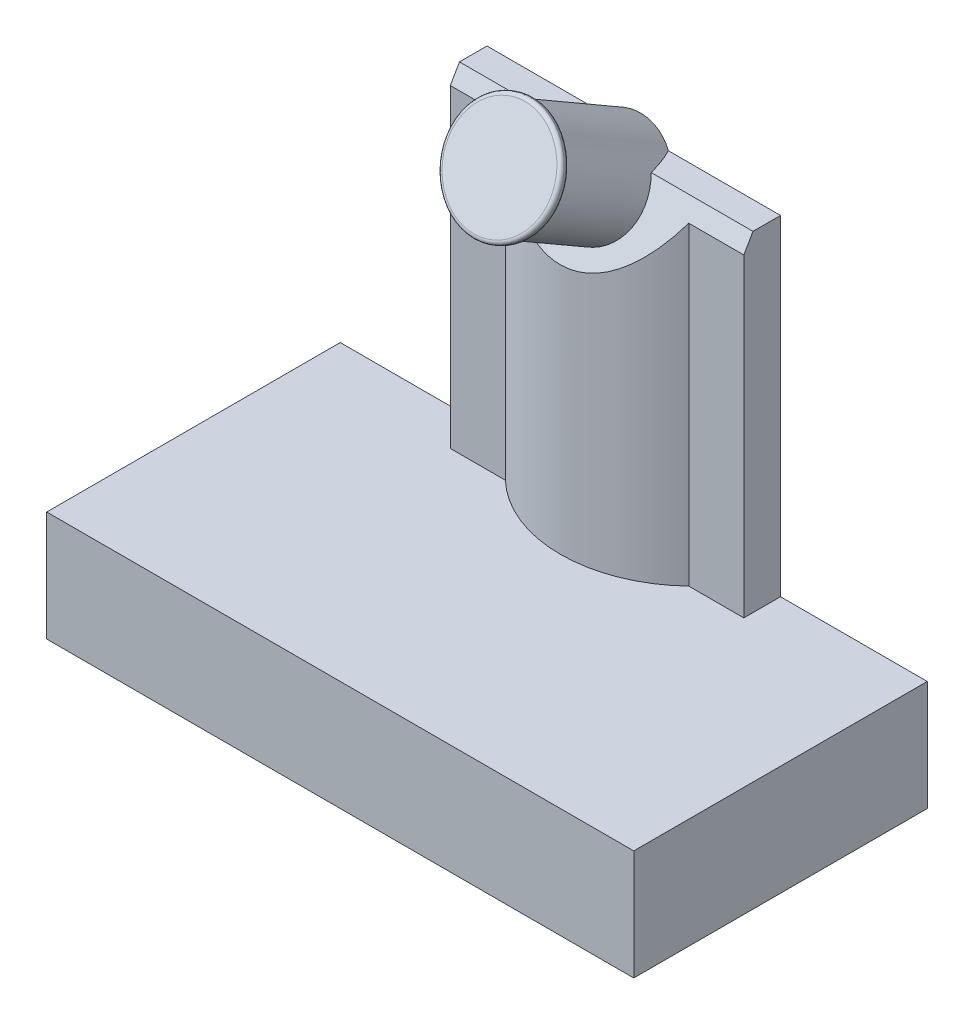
ISO-10303-21;
HEADER;
FILE_DESCRIPTION(('STEP AP214'),'2;1');
FILE_NAME('part.step','',(''),(''),'','','');
FILE_SCHEMA(('AUTOMOTIVE_DESIGN { 1 0 10303 214 1 1 1 1 }'));
ENDSEC;
DATA;
#1=APPLICATION_CONTEXT('core data for automotive mechanical design processes');
#2=APPLICATION_PROTOCOL_DEFINITION('international standard','automotive_design',2000,#1);
#3=PRODUCT_CONTEXT('',#1,'mechanical');
#4=PRODUCT('Part','Part','',(#3));
#5=PRODUCT_RELATED_PRODUCT_CATEGORY('part','',(#4));
#6=PRODUCT_DEFINITION_FORMATION('','',#4);
#7=PRODUCT_DEFINITION_CONTEXT('part definition',#1,'design');
#8=PRODUCT_DEFINITION('design','',#6,#7);
#9=PRODUCT_DEFINITION_SHAPE('','',#8);
#10=(LENGTH_UNIT() NAMED_UNIT(*) SI_UNIT(.MILLI.,.METRE.));
#11=(NAMED_UNIT(*) PLANE_ANGLE_UNIT() SI_UNIT($,.RADIAN.));
#12=(NAMED_UNIT(*) SI_UNIT($,.STERADIAN.) SOLID_ANGLE_UNIT());
#13=UNCERTAINTY_MEASURE_WITH_UNIT(LENGTH_MEASURE(1.E-05),#10,'distance_accuracy_value','');
#14=(GEOMETRIC_REPRESENTATION_CONTEXT(3) GLOBAL_UNCERTAINTY_ASSIGNED_CONTEXT((#13)) GLOBAL_UNIT_ASSIGNED_CONTEXT((#10,
#11,#12)) REPRESENTATION_CONTEXT('',''));
#15=CARTESIAN_POINT('',(0.,0.,0.));
#16=DIRECTION('',(0.,0.,1.));
#17=DIRECTION('',(1.,0.,0.));
#18=AXIS2_PLACEMENT_3D('',#15,#16,#17);
#19=CARTESIAN_POINT('',(8.,8.45873412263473,1.0625));
#20=DIRECTION('',(0.,-0.500000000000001,-0.866025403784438));
#21=DIRECTION('',(0.,0.866025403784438,-0.500000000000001));
#22=AXIS2_PLACEMENT_3D('',#19,#20,#21);
#23=CYLINDRICAL_SURFACE('',#22,1.375);
#24=CARTESIAN_POINT('',(8.,8.13397459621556,0.5));
#25=DIRECTION('',(0.,-0.500000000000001,-0.866025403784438));
#26=DIRECTION('',(0.,0.866025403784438,-0.500000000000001));
#27=AXIS2_PLACEMENT_3D('',#24,#25,#26);
#28=CIRCLE('',#27,1.375);
#29=CARTESIAN_POINT('',(7.05627069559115,9.,0.));
#30=VERTEX_POINT('',#29);
#31=CARTESIAN_POINT('',(8.94372930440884,9.,0.));
#32=VERTEX_POINT('',#31);
#33=EDGE_CURVE('E168',#30,#32,#28,.T.);
#34=ORIENTED_EDGE('',*,*,#33,.F.);
#35=CARTESIAN_POINT('',(8.,9.,1.99999999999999));
#36=DIRECTION('',(0.,1.,0.));
#37=DIRECTION('',(0.,0.,-1.));
#38=AXIS2_PLACEMENT_3D('',#35,#36,#37);
#39=ELLIPSE('',#38,2.74999999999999,1.375);
#40=CARTESIAN_POINT('',(6.77525512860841,9.,0.749999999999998));
#41=VERTEX_POINT('',#40);
#42=EDGE_CURVE('E167',#30,#41,#39,.T.);
#43=ORIENTED_EDGE('',*,*,#42,.T.);
#44=CARTESIAN_POINT('',(8.,8.45873412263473,1.0625));
#45=DIRECTION('',(0.,0.500000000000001,0.866025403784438));
#46=DIRECTION('',(0.,-0.866025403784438,0.500000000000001));
#47=AXIS2_PLACEMENT_3D('',#44,#45,#46);
#48=CIRCLE('',#47,1.375);
#49=CARTESIAN_POINT('',(9.22474487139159,9.,0.75));
#50=VERTEX_POINT('',#49);
#51=EDGE_CURVE('E55',#41,#50,#48,.T.);
#52=ORIENTED_EDGE('',*,*,#51,.T.);
#53=EDGE_CURVE('E161',#50,#32,#39,.T.);
#54=ORIENTED_EDGE('',*,*,#53,.T.);
#55=EDGE_LOOP('',(#34,#43,#52,#54));
#56=FACE_BOUND('',#55,.T.);
#57=CARTESIAN_POINT('',(8.,9.83373412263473,3.44406986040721));
#58=DIRECTION('',(0.,0.500000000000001,0.866025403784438));
#59=DIRECTION('',(0.,-0.866025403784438,0.500000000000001));
#60=AXIS2_PLACEMENT_3D('',#57,#58,#59);
#61=CIRCLE('',#60,1.375);
#62=CARTESIAN_POINT('',(8.,8.64294919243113,4.13156986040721));
#63=VERTEX_POINT('',#62);
#64=EDGE_CURVE('E345',#63,#63,#61,.F.);
#65=ORIENTED_EDGE('',*,*,#64,.T.);
#66=EDGE_LOOP('',(#65));
#67=FACE_BOUND('',#66,.T.);
#68=ADVANCED_FACE('F32',(#56,#67),#23,.T.);
#69=CARTESIAN_POINT('',(12.6906537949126,10.1622136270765,0.0789956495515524));
#70=DIRECTION('',(0.,-0.500000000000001,-0.866025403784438));
#71=DIRECTION('',(0.,0.866025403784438,-0.500000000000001));
#72=AXIS2_PLACEMENT_3D('',#69,#70,#71);
#73=PLANE('',#72);
#74=ORIENTED_EDGE('',*,*,#51,.F.);
#75=DIRECTION('',(1.,0.,0.));
#76=VECTOR('',#75,1.);
#77=CARTESIAN_POINT('',(5.5,9.,0.75));
#78=LINE('',#77,#76);
#79=CARTESIAN_POINT('',(4.,9.,0.749999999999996));
#80=VERTEX_POINT('',#79);
#81=EDGE_CURVE('E157',#80,#41,#78,.T.);
#82=ORIENTED_EDGE('',*,*,#81,.F.);
#83=DIRECTION('',(0.,0.866025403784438,-0.500000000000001));
#84=VECTOR('',#83,1.);
#85=CARTESIAN_POINT('',(4.,9.32475952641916,0.562499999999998));
#86=LINE('',#85,#84);
#87=CARTESIAN_POINT('',(4.,8.56698729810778,1.));
#88=VERTEX_POINT('',#87);
#89=EDGE_CURVE('E315',#88,#80,#86,.T.);
#90=ORIENTED_EDGE('',*,*,#89,.F.);
#91=DIRECTION('',(-1.,0.,0.));
#92=VECTOR('',#91,1.);
#93=CARTESIAN_POINT('',(4.,8.56698729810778,1.));
#94=LINE('',#93,#92);
#95=CARTESIAN_POINT('',(5.5,8.56698729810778,0.999999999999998));
#96=VERTEX_POINT('',#95);
#97=EDGE_CURVE('E319',#96,#88,#94,.T.);
#98=ORIENTED_EDGE('',*,*,#97,.F.);
#99=CARTESIAN_POINT('',(8.,13.1136206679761,-1.625));
#100=DIRECTION('',(0.,-0.500000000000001,-0.866025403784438));
#101=DIRECTION('',(0.,-0.866025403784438,0.500000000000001));
#102=AXIS2_PLACEMENT_3D('',#99,#100,#101);
#103=ELLIPSE('',#102,7.24999999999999,3.625);
#104=CARTESIAN_POINT('',(10.5,8.56698729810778,0.999999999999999));
#105=VERTEX_POINT('',#104);
#106=EDGE_CURVE('E335',#105,#96,#103,.T.);
#107=ORIENTED_EDGE('',*,*,#106,.F.);
#108=DIRECTION('',(-1.,0.,0.));
#109=VECTOR('',#108,1.);
#110=CARTESIAN_POINT('',(10.5,8.56698729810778,0.999999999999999));
#111=LINE('',#110,#109);
#112=CARTESIAN_POINT('',(12.,8.56698729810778,0.999999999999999));
#113=VERTEX_POINT('',#112);
#114=EDGE_CURVE('E338',#113,#105,#111,.T.);
#115=ORIENTED_EDGE('',*,*,#114,.F.);
#116=DIRECTION('',(0.,-0.866025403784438,0.500000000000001));
#117=VECTOR('',#116,1.);
#118=CARTESIAN_POINT('',(12.,9.32475952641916,0.562499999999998));
#119=LINE('',#118,#117);
#120=CARTESIAN_POINT('',(12.,9.,0.749999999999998));
#121=VERTEX_POINT('',#120);
#122=EDGE_CURVE('E154',#121,#113,#119,.T.);
#123=ORIENTED_EDGE('',*,*,#122,.F.);
#124=EDGE_CURVE('E150',#50,#121,#78,.T.);
#125=ORIENTED_EDGE('',*,*,#124,.F.);
#126=EDGE_LOOP('',(#74,#82,#90,#98,#107,#115,#123,#125));
#127=FACE_BOUND('',#126,.T.);
#128=ADVANCED_FACE('F152',(#127),#73,.F.);
#129=CARTESIAN_POINT('',(8.,9.,-1.625));
#130=DIRECTION('',(0.,1.,0.));
#131=DIRECTION('',(0.,0.,1.));
#132=AXIS2_PLACEMENT_3D('',#129,#130,#131);
#133=PLANE('',#132);
#134=ORIENTED_EDGE('',*,*,#42,.F.);
#135=DIRECTION('',(-1.,0.,0.));
#136=VECTOR('',#135,1.);
#137=CARTESIAN_POINT('',(4.,9.,0.));
#138=LINE('',#137,#136);
#139=CARTESIAN_POINT('',(4.,9.,0.));
#140=VERTEX_POINT('',#139);
#141=EDGE_CURVE('E325',#30,#140,#138,.T.);
#142=ORIENTED_EDGE('',*,*,#141,.T.);
#143=DIRECTION('',(0.,0.,1.));
#144=VECTOR('',#143,1.);
#145=CARTESIAN_POINT('',(4.,9.,0.));
#146=LINE('',#145,#144);
#147=EDGE_CURVE('E198',#140,#80,#146,.T.);
#148=ORIENTED_EDGE('',*,*,#147,.T.);
#149=ORIENTED_EDGE('',*,*,#81,.T.);
#150=EDGE_LOOP('',(#134,#142,#148,#149));
#151=FACE_BOUND('',#150,.T.);
#152=ADVANCED_FACE('F384',(#151),#133,.T.);
#153=CARTESIAN_POINT('',(0.,-0.999999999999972,8.));
#154=DIRECTION('',(0.,1.,0.));
#155=DIRECTION('',(0.,0.,1.));
#156=AXIS2_PLACEMENT_3D('',#153,#154,#155);
#157=PLANE('',#156);
#158=DIRECTION('',(-1.,0.,0.));
#159=VECTOR('',#158,1.);
#160=CARTESIAN_POINT('',(0.999999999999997,-0.999999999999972,7.));
#161=LINE('',#160,#159);
#162=CARTESIAN_POINT('',(15.,-0.999999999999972,7.));
#163=VERTEX_POINT('',#162);
#164=CARTESIAN_POINT('',(0.999999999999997,-0.999999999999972,7.));
#165=VERTEX_POINT('',#164);
#166=EDGE_CURVE('E226',#163,#165,#161,.T.);
#167=ORIENTED_EDGE('',*,*,#166,.T.);
#168=DIRECTION('',(0.,0.,-1.));
#169=VECTOR('',#168,1.);
#170=CARTESIAN_POINT('',(0.999999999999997,-0.999999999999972,0.999999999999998));
#171=LINE('',#170,#169);
#172=CARTESIAN_POINT('',(0.999999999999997,-0.999999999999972,0.999999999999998));
#173=VERTEX_POINT('',#172);
#174=EDGE_CURVE('E222',#165,#173,#171,.T.);
#175=ORIENTED_EDGE('',*,*,#174,.T.);
#176=DIRECTION('',(1.,0.,0.));
#177=VECTOR('',#176,1.);
#178=CARTESIAN_POINT('',(0.999999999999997,-0.999999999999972,0.999999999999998));
#179=LINE('',#178,#177);
#180=CARTESIAN_POINT('',(15.,-0.999999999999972,0.999999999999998));
#181=VERTEX_POINT('',#180);
#182=EDGE_CURVE('E236',#173,#181,#179,.T.);
#183=ORIENTED_EDGE('',*,*,#182,.T.);
#184=DIRECTION('',(0.,0.,1.));
#185=VECTOR('',#184,1.);
#186=CARTESIAN_POINT('',(15.,-0.999999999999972,0.999999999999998));
#187=LINE('',#186,#185);
#188=EDGE_CURVE('E239',#181,#163,#187,.T.);
#189=ORIENTED_EDGE('',*,*,#188,.T.);
#190=EDGE_LOOP('',(#167,#175,#183,#189));
#191=FACE_BOUND('',#190,.T.);
#192=CARTESIAN_POINT('',(8.,-0.999999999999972,4.));
#193=DIRECTION('',(0.,1.,0.));
#194=DIRECTION('',(0.,0.,1.));
#195=AXIS2_PLACEMENT_3D('',#192,#193,#194);
#196=CIRCLE('',#195,1.5);
#197=CARTESIAN_POINT('',(8.,-0.999999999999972,5.5));
#198=VERTEX_POINT('',#197);
#199=EDGE_CURVE('E158',#198,#198,#196,.F.);
#200=ORIENTED_EDGE('',*,*,#199,.F.);
#201=EDGE_LOOP('',(#200));
#202=FACE_BOUND('',#201,.T.);
#203=ADVANCED_FACE('F444',(#191,#202),#157,.F.);
#204=CARTESIAN_POINT('',(0.,-0.999999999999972,0.));
#205=DIRECTION('',(-1.,0.,0.));
#206=DIRECTION('',(0.,0.,1.));
#207=AXIS2_PLACEMENT_3D('',#204,#205,#206);
#208=PLANE('',#207);
#209=DIRECTION('',(0.,0.,1.));
#210=VECTOR('',#209,1.);
#211=CARTESIAN_POINT('',(0.,0.,0.));
#212=LINE('',#211,#210);
#213=CARTESIAN_POINT('',(0.,0.,0.));
#214=VERTEX_POINT('',#213);
#215=CARTESIAN_POINT('',(0.,0.,8.));
#216=VERTEX_POINT('',#215);
#217=EDGE_CURVE('E264',#214,#216,#212,.T.);
#218=ORIENTED_EDGE('',*,*,#217,.F.);
#219=DIRECTION('',(0.,1.,0.));
#220=VECTOR('',#219,1.);
#221=CARTESIAN_POINT('',(0.,-0.999999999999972,0.));
#222=LINE('',#221,#220);
#223=CARTESIAN_POINT('',(0.,-2.99999999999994,0.));
#224=VERTEX_POINT('',#223);
#225=EDGE_CURVE('E276',#224,#214,#222,.T.);
#226=ORIENTED_EDGE('',*,*,#225,.F.);
#227=DIRECTION('',(0.,0.,-1.));
#228=VECTOR('',#227,1.);
#229=CARTESIAN_POINT('',(0.,-2.99999999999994,8.));
#230=LINE('',#229,#228);
#231=CARTESIAN_POINT('',(0.,-2.99999999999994,8.));
#232=VERTEX_POINT('',#231);
#233=EDGE_CURVE('E258',#232,#224,#230,.T.);
#234=ORIENTED_EDGE('',*,*,#233,.F.);
#235=DIRECTION('',(0.,1.,0.));
#236=VECTOR('',#235,1.);
#237=CARTESIAN_POINT('',(0.,-0.999999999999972,8.));
#238=LINE('',#237,#236);
#239=EDGE_CURVE('E284',#232,#216,#238,.T.);
#240=ORIENTED_EDGE('',*,*,#239,.T.);
#241=EDGE_LOOP('',(#218,#226,#234,#240));
#242=FACE_BOUND('',#241,.T.);
#243=ADVANCED_FACE('F303',(#242),#208,.T.);
#244=CARTESIAN_POINT('',(0.,-0.999999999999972,0.));
#245=DIRECTION('',(0.,0.,-1.));
#246=DIRECTION('',(-1.,0.,0.));
#247=AXIS2_PLACEMENT_3D('',#244,#245,#246);
#248=PLANE('',#247);
#249=DIRECTION('',(-1.,0.,0.));
#250=VECTOR('',#249,1.);
#251=CARTESIAN_POINT('',(0.,0.,0.));
#252=LINE('',#251,#250);
#253=CARTESIAN_POINT('',(16.,0.,0.));
#254=VERTEX_POINT('',#253);
#255=CARTESIAN_POINT('',(12.,0.,0.));
#256=VERTEX_POINT('',#255);
#257=EDGE_CURVE('E282',#254,#256,#252,.T.);
#258=ORIENTED_EDGE('',*,*,#257,.F.);
#259=DIRECTION('',(0.,1.,0.));
#260=VECTOR('',#259,1.);
#261=CARTESIAN_POINT('',(16.,-0.999999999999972,0.));
#262=LINE('',#261,#260);
#263=CARTESIAN_POINT('',(16.,-2.99999999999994,0.));
#264=VERTEX_POINT('',#263);
#265=EDGE_CURVE('E289',#264,#254,#262,.T.);
#266=ORIENTED_EDGE('',*,*,#265,.F.);
#267=DIRECTION('',(1.,0.,0.));
#268=VECTOR('',#267,1.);
#269=CARTESIAN_POINT('',(16.,-2.99999999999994,0.));
#270=LINE('',#269,#268);
#271=EDGE_CURVE('E261',#224,#264,#270,.T.);
#272=ORIENTED_EDGE('',*,*,#271,.F.);
#273=ORIENTED_EDGE('',*,*,#225,.T.);
#274=CARTESIAN_POINT('',(4.,0.,0.));
#275=VERTEX_POINT('',#274);
#276=EDGE_CURVE('E273',#275,#214,#252,.T.);
#277=ORIENTED_EDGE('',*,*,#276,.F.);
#278=DIRECTION('',(0.,-1.,0.));
#279=VECTOR('',#278,1.);
#280=CARTESIAN_POINT('',(4.,9.,0.));
#281=LINE('',#280,#279);
#282=EDGE_CURVE('E193',#140,#275,#281,.T.);
#283=ORIENTED_EDGE('',*,*,#282,.F.);
#284=ORIENTED_EDGE('',*,*,#141,.F.);
#285=EDGE_CURVE('E47',#32,#30,#138,.T.);
#286=ORIENTED_EDGE('',*,*,#285,.F.);
#287=CARTESIAN_POINT('',(12.,9.,0.));
#288=VERTEX_POINT('',#287);
#289=EDGE_CURVE('E163',#288,#32,#138,.T.);
#290=ORIENTED_EDGE('',*,*,#289,.F.);
#291=DIRECTION('',(0.,-1.,0.));
#292=VECTOR('',#291,1.);
#293=CARTESIAN_POINT('',(12.,9.,0.));
#294=LINE('',#293,#292);
#295=EDGE_CURVE('E189',#288,#256,#294,.T.);
#296=ORIENTED_EDGE('',*,*,#295,.T.);
#297=EDGE_LOOP('',(#258,#266,#272,#273,#277,#283,#284,#286,#290,#296));
#298=FACE_BOUND('',#297,.T.);
#299=ADVANCED_FACE('F298',(#298),#248,.T.);
#300=CARTESIAN_POINT('',(16.,-0.999999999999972,0.));
#301=DIRECTION('',(1.,0.,0.));
#302=DIRECTION('',(0.,0.,-1.));
#303=AXIS2_PLACEMENT_3D('',#300,#301,#302);
#304=PLANE('',#303);
#305=DIRECTION('',(0.,0.,-1.));
#306=VECTOR('',#305,1.);
#307=CARTESIAN_POINT('',(16.,0.,0.));
#308=LINE('',#307,#306);
#309=CARTESIAN_POINT('',(16.,0.,8.));
#310=VERTEX_POINT('',#309);
#311=EDGE_CURVE('E270',#310,#254,#308,.T.);
#312=ORIENTED_EDGE('',*,*,#311,.F.);
#313=DIRECTION('',(0.,1.,0.));
#314=VECTOR('',#313,1.);
#315=CARTESIAN_POINT('',(16.,-0.999999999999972,8.));
#316=LINE('',#315,#314);
#317=CARTESIAN_POINT('',(16.,-2.99999999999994,8.));
#318=VERTEX_POINT('',#317);
#319=EDGE_CURVE('E288',#318,#310,#316,.T.);
#320=ORIENTED_EDGE('',*,*,#319,.F.);
#321=DIRECTION('',(0.,0.,1.));
#322=VECTOR('',#321,1.);
#323=CARTESIAN_POINT('',(16.,-2.99999999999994,8.));
#324=LINE('',#323,#322);
#325=EDGE_CURVE('E252',#264,#318,#324,.T.);
#326=ORIENTED_EDGE('',*,*,#325,.F.);
#327=ORIENTED_EDGE('',*,*,#265,.T.);
#328=EDGE_LOOP('',(#312,#320,#326,#327));
#329=FACE_BOUND('',#328,.T.);
#330=ADVANCED_FACE('F450',(#329),#304,.T.);
#331=CARTESIAN_POINT('',(0.,-0.999999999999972,8.));
#332=DIRECTION('',(0.,0.,1.));
#333=DIRECTION('',(1.,0.,0.));
#334=AXIS2_PLACEMENT_3D('',#331,#332,#333);
#335=PLANE('',#334);
#336=DIRECTION('',(1.,0.,0.));
#337=VECTOR('',#336,1.);
#338=CARTESIAN_POINT('',(0.,0.,8.));
#339=LINE('',#338,#337);
#340=EDGE_CURVE('E267',#216,#310,#339,.T.);
#341=ORIENTED_EDGE('',*,*,#340,.F.);
#342=ORIENTED_EDGE('',*,*,#239,.F.);
#343=DIRECTION('',(-1.,0.,0.));
#344=VECTOR('',#343,1.);
#345=CARTESIAN_POINT('',(16.,-2.99999999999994,8.));
#346=LINE('',#345,#344);
#347=EDGE_CURVE('E255',#318,#232,#346,.T.);
#348=ORIENTED_EDGE('',*,*,#347,.F.);
#349=ORIENTED_EDGE('',*,*,#319,.T.);
#350=EDGE_LOOP('',(#341,#342,#348,#349));
#351=FACE_BOUND('',#350,.T.);
#352=ADVANCED_FACE('F447',(#351),#335,.T.);
#353=CARTESIAN_POINT('',(0.,0.,8.));
#354=DIRECTION('',(0.,1.,0.));
#355=DIRECTION('',(0.,0.,1.));
#356=AXIS2_PLACEMENT_3D('',#353,#354,#355);
#357=PLANE('',#356);
#358=DIRECTION('',(0.,0.,1.));
#359=VECTOR('',#358,1.);
#360=CARTESIAN_POINT('',(4.,0.,0.));
#361=LINE('',#360,#359);
#362=CARTESIAN_POINT('',(4.,0.,1.));
#363=VERTEX_POINT('',#362);
#364=EDGE_CURVE('E309',#275,#363,#361,.T.);
#365=ORIENTED_EDGE('',*,*,#364,.F.);
#366=ORIENTED_EDGE('',*,*,#276,.T.);
#367=ORIENTED_EDGE('',*,*,#217,.T.);
#368=ORIENTED_EDGE('',*,*,#340,.T.);
#369=ORIENTED_EDGE('',*,*,#311,.T.);
#370=ORIENTED_EDGE('',*,*,#257,.T.);
#371=DIRECTION('',(0.,0.,-1.));
#372=VECTOR('',#371,1.);
#373=CARTESIAN_POINT('',(12.,0.,0.));
#374=LINE('',#373,#372);
#375=CARTESIAN_POINT('',(12.,0.,0.999999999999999));
#376=VERTEX_POINT('',#375);
#377=EDGE_CURVE('E194',#376,#256,#374,.T.);
#378=ORIENTED_EDGE('',*,*,#377,.F.);
#379=DIRECTION('',(1.,0.,0.));
#380=VECTOR('',#379,1.);
#381=CARTESIAN_POINT('',(10.5,0.,0.999999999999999));
#382=LINE('',#381,#380);
#383=CARTESIAN_POINT('',(10.5,0.,0.999999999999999));
#384=VERTEX_POINT('',#383);
#385=EDGE_CURVE('E199',#384,#376,#382,.T.);
#386=ORIENTED_EDGE('',*,*,#385,.F.);
#387=CARTESIAN_POINT('',(8.,0.,-1.625));
#388=DIRECTION('',(0.,1.,0.));
#389=DIRECTION('',(0.,0.,1.));
#390=AXIS2_PLACEMENT_3D('',#387,#388,#389);
#391=CIRCLE('',#390,3.625);
#392=CARTESIAN_POINT('',(5.5,0.,0.999999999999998));
#393=VERTEX_POINT('',#392);
#394=EDGE_CURVE('E316',#393,#384,#391,.T.);
#395=ORIENTED_EDGE('',*,*,#394,.F.);
#396=DIRECTION('',(1.,0.,0.));
#397=VECTOR('',#396,1.);
#398=CARTESIAN_POINT('',(4.,0.,1.));
#399=LINE('',#398,#397);
#400=EDGE_CURVE('E312',#363,#393,#399,.T.);
#401=ORIENTED_EDGE('',*,*,#400,.F.);
#402=EDGE_LOOP('',(#365,#366,#367,#368,#369,#370,#378,#386,#395,#401));
#403=FACE_BOUND('',#402,.T.);
#404=ADVANCED_FACE('F306',(#403),#357,.T.);
#405=CARTESIAN_POINT('',(16.,-2.99999999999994,0.));
#406=DIRECTION('',(0.,1.,0.));
#407=DIRECTION('',(0.,0.,1.));
#408=AXIS2_PLACEMENT_3D('',#405,#406,#407);
#409=PLANE('',#408);
#410=ORIENTED_EDGE('',*,*,#325,.T.);
#411=ORIENTED_EDGE('',*,*,#347,.T.);
#412=ORIENTED_EDGE('',*,*,#233,.T.);
#413=ORIENTED_EDGE('',*,*,#271,.T.);
#414=EDGE_LOOP('',(#410,#411,#412,#413));
#415=FACE_BOUND('',#414,.T.);
#416=DIRECTION('',(0.,0.,-1.));
#417=VECTOR('',#416,1.);
#418=CARTESIAN_POINT('',(0.999999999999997,-2.99999999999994,0.999999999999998));
#419=LINE('',#418,#417);
#420=CARTESIAN_POINT('',(0.999999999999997,-2.99999999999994,7.));
#421=VERTEX_POINT('',#420);
#422=CARTESIAN_POINT('',(0.999999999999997,-2.99999999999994,0.999999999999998));
#423=VERTEX_POINT('',#422);
#424=EDGE_CURVE('E223',#421,#423,#419,.T.);
#425=ORIENTED_EDGE('',*,*,#424,.F.);
#426=DIRECTION('',(-1.,0.,0.));
#427=VECTOR('',#426,1.);
#428=CARTESIAN_POINT('',(0.999999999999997,-2.99999999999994,7.));
#429=LINE('',#428,#427);
#430=CARTESIAN_POINT('',(15.,-2.99999999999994,7.));
#431=VERTEX_POINT('',#430);
#432=EDGE_CURVE('E231',#431,#421,#429,.T.);
#433=ORIENTED_EDGE('',*,*,#432,.F.);
#434=DIRECTION('',(0.,0.,1.));
#435=VECTOR('',#434,1.);
#436=CARTESIAN_POINT('',(15.,-2.99999999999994,0.999999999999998));
#437=LINE('',#436,#435);
#438=CARTESIAN_POINT('',(15.,-2.99999999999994,0.999999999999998));
#439=VERTEX_POINT('',#438);
#440=EDGE_CURVE('E228',#439,#431,#437,.T.);
#441=ORIENTED_EDGE('',*,*,#440,.F.);
#442=DIRECTION('',(1.,0.,0.));
#443=VECTOR('',#442,1.);
#444=CARTESIAN_POINT('',(0.999999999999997,-2.99999999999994,0.999999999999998));
#445=LINE('',#444,#443);
#446=EDGE_CURVE('E225',#423,#439,#445,.T.);
#447=ORIENTED_EDGE('',*,*,#446,.F.);
#448=EDGE_LOOP('',(#425,#433,#441,#447));
#449=FACE_BOUND('',#448,.T.);
#450=ADVANCED_FACE('F436',(#415,#449),#409,.F.);
#451=CARTESIAN_POINT('',(0.999999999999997,-2.99999999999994,0.999999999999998));
#452=DIRECTION('',(1.,0.,0.));
#453=DIRECTION('',(0.,0.,-1.));
#454=AXIS2_PLACEMENT_3D('',#451,#452,#453);
#455=PLANE('',#454);
#456=ORIENTED_EDGE('',*,*,#174,.F.);
#457=DIRECTION('',(0.,1.,0.));
#458=VECTOR('',#457,1.);
#459=CARTESIAN_POINT('',(0.999999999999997,-2.99999999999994,7.));
#460=LINE('',#459,#458);
#461=EDGE_CURVE('E233',#421,#165,#460,.T.);
#462=ORIENTED_EDGE('',*,*,#461,.F.);
#463=ORIENTED_EDGE('',*,*,#424,.T.);
#464=DIRECTION('',(0.,1.,0.));
#465=VECTOR('',#464,1.);
#466=CARTESIAN_POINT('',(0.999999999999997,-2.99999999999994,0.999999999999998));
#467=LINE('',#466,#465);
#468=EDGE_CURVE('E249',#423,#173,#467,.T.);
#469=ORIENTED_EDGE('',*,*,#468,.T.);
#470=EDGE_LOOP('',(#456,#462,#463,#469));
#471=FACE_BOUND('',#470,.T.);
#472=ADVANCED_FACE('F432',(#471),#455,.T.);
#473=CARTESIAN_POINT('',(0.999999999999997,-2.99999999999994,0.999999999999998));
#474=DIRECTION('',(0.,0.,1.));
#475=DIRECTION('',(1.,0.,0.));
#476=AXIS2_PLACEMENT_3D('',#473,#474,#475);
#477=PLANE('',#476);
#478=ORIENTED_EDGE('',*,*,#182,.F.);
#479=ORIENTED_EDGE('',*,*,#468,.F.);
#480=ORIENTED_EDGE('',*,*,#446,.T.);
#481=DIRECTION('',(0.,1.,0.));
#482=VECTOR('',#481,1.);
#483=CARTESIAN_POINT('',(15.,-2.99999999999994,0.999999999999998));
#484=LINE('',#483,#482);
#485=EDGE_CURVE('E247',#439,#181,#484,.T.);
#486=ORIENTED_EDGE('',*,*,#485,.T.);
#487=EDGE_LOOP('',(#478,#479,#480,#486));
#488=FACE_BOUND('',#487,.T.);
#489=ADVANCED_FACE('F428',(#488),#477,.T.);
#490=CARTESIAN_POINT('',(15.,-2.99999999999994,0.999999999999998));
#491=DIRECTION('',(-1.,0.,0.));
#492=DIRECTION('',(0.,0.,1.));
#493=AXIS2_PLACEMENT_3D('',#490,#491,#492);
#494=PLANE('',#493);
#495=ORIENTED_EDGE('',*,*,#188,.F.);
#496=ORIENTED_EDGE('',*,*,#485,.F.);
#497=ORIENTED_EDGE('',*,*,#440,.T.);
#498=DIRECTION('',(0.,1.,0.));
#499=VECTOR('',#498,1.);
#500=CARTESIAN_POINT('',(15.,-2.99999999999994,7.));
#501=LINE('',#500,#499);
#502=EDGE_CURVE('E245',#431,#163,#501,.T.);
#503=ORIENTED_EDGE('',*,*,#502,.T.);
#504=EDGE_LOOP('',(#495,#496,#497,#503));
#505=FACE_BOUND('',#504,.T.);
#506=ADVANCED_FACE('F424',(#505),#494,.T.);
#507=CARTESIAN_POINT('',(0.999999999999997,-2.99999999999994,7.));
#508=DIRECTION('',(0.,0.,-1.));
#509=DIRECTION('',(-1.,0.,0.));
#510=AXIS2_PLACEMENT_3D('',#507,#508,#509);
#511=PLANE('',#510);
#512=ORIENTED_EDGE('',*,*,#166,.F.);
#513=ORIENTED_EDGE('',*,*,#502,.F.);
#514=ORIENTED_EDGE('',*,*,#432,.T.);
#515=ORIENTED_EDGE('',*,*,#461,.T.);
#516=EDGE_LOOP('',(#512,#513,#514,#515));
#517=FACE_BOUND('',#516,.T.);
#518=ADVANCED_FACE('F417',(#517),#511,.T.);
#519=CARTESIAN_POINT('',(8.,-2.99999999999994,4.));
#520=DIRECTION('',(0.,-1.,0.));
#521=DIRECTION('',(0.,0.,-1.));
#522=AXIS2_PLACEMENT_3D('',#519,#520,#521);
#523=PLANE('',#522);
#524=CARTESIAN_POINT('',(8.,-2.99999999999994,4.));
#525=DIRECTION('',(0.,-1.,0.));
#526=DIRECTION('',(0.,0.,-1.));
#527=AXIS2_PLACEMENT_3D('',#524,#525,#526);
#528=CIRCLE('',#527,1.5);
#529=CARTESIAN_POINT('',(8.,-2.99999999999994,2.5));
#530=VERTEX_POINT('',#529);
#531=EDGE_CURVE('E217',#530,#530,#528,.T.);
#532=ORIENTED_EDGE('',*,*,#531,.T.);
#533=EDGE_LOOP('',(#532));
#534=FACE_BOUND('',#533,.T.);
#535=CARTESIAN_POINT('',(8.,-2.99999999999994,4.));
#536=DIRECTION('',(0.,-1.,0.));
#537=DIRECTION('',(0.,0.,-1.));
#538=AXIS2_PLACEMENT_3D('',#535,#536,#537);
#539=CIRCLE('',#538,1.);
#540=CARTESIAN_POINT('',(8.,-2.99999999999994,3.));
#541=VERTEX_POINT('',#540);
#542=EDGE_CURVE('E214',#541,#541,#539,.T.);
#543=ORIENTED_EDGE('',*,*,#542,.F.);
#544=EDGE_LOOP('',(#543));
#545=FACE_BOUND('',#544,.T.);
#546=ADVANCED_FACE('F414',(#534,#545),#523,.T.);
#547=CARTESIAN_POINT('',(8.,-2.99999999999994,4.));
#548=DIRECTION('',(0.,1.,0.));
#549=DIRECTION('',(0.,0.,1.));
#550=AXIS2_PLACEMENT_3D('',#547,#548,#549);
#551=CYLINDRICAL_SURFACE('',#550,1.5);
#552=ORIENTED_EDGE('',*,*,#531,.F.);
#553=EDGE_LOOP('',(#552));
#554=FACE_BOUND('',#553,.T.);
#555=ORIENTED_EDGE('',*,*,#199,.T.);
#556=EDGE_LOOP('',(#555));
#557=FACE_BOUND('',#556,.T.);
#558=ADVANCED_FACE('F412',(#554,#557),#551,.T.);
#559=CARTESIAN_POINT('',(8.,-2.99999999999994,4.));
#560=DIRECTION('',(0.,1.,0.));
#561=DIRECTION('',(0.,0.,1.));
#562=AXIS2_PLACEMENT_3D('',#559,#560,#561);
#563=CYLINDRICAL_SURFACE('',#562,1.);
#564=ORIENTED_EDGE('',*,*,#542,.T.);
#565=EDGE_LOOP('',(#564));
#566=FACE_BOUND('',#565,.T.);
#567=CARTESIAN_POINT('',(8.,-0.999999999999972,4.));
#568=DIRECTION('',(0.,-1.,0.));
#569=DIRECTION('',(0.,0.,-1.));
#570=AXIS2_PLACEMENT_3D('',#567,#568,#569);
#571=CIRCLE('',#570,1.);
#572=CARTESIAN_POINT('',(8.,-0.999999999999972,3.));
#573=VERTEX_POINT('',#572);
#574=EDGE_CURVE('E213',#573,#573,#571,.T.);
#575=ORIENTED_EDGE('',*,*,#574,.F.);
#576=EDGE_LOOP('',(#575));
#577=FACE_BOUND('',#576,.T.);
#578=ADVANCED_FACE('F409',(#566,#577),#563,.F.);
#579=ORIENTED_EDGE('',*,*,#574,.T.);
#580=EDGE_LOOP('',(#579));
#581=FACE_BOUND('',#580,.T.);
#582=ADVANCED_FACE('F408',(#581),#157,.F.);
#583=CARTESIAN_POINT('',(4.,9.,0.));
#584=DIRECTION('',(1.,0.,0.));
#585=DIRECTION('',(0.,0.,-1.));
#586=AXIS2_PLACEMENT_3D('',#583,#584,#585);
#587=PLANE('',#586);
#588=DIRECTION('',(0.,-1.,0.));
#589=VECTOR('',#588,1.);
#590=CARTESIAN_POINT('',(4.,9.,1.));
#591=LINE('',#590,#589);
#592=EDGE_CURVE('E211',#88,#363,#591,.T.);
#593=ORIENTED_EDGE('',*,*,#592,.F.);
#594=ORIENTED_EDGE('',*,*,#89,.T.);
#595=ORIENTED_EDGE('',*,*,#147,.F.);
#596=ORIENTED_EDGE('',*,*,#282,.T.);
#597=ORIENTED_EDGE('',*,*,#364,.T.);
#598=EDGE_LOOP('',(#593,#594,#595,#596,#597));
#599=FACE_BOUND('',#598,.T.);
#600=ADVANCED_FACE('F404',(#599),#587,.F.);
#601=CARTESIAN_POINT('',(4.,9.,1.));
#602=DIRECTION('',(0.,0.,-1.));
#603=DIRECTION('',(-1.,0.,0.));
#604=AXIS2_PLACEMENT_3D('',#601,#602,#603);
#605=PLANE('',#604);
#606=DIRECTION('',(0.,-1.,0.));
#607=VECTOR('',#606,1.);
#608=CARTESIAN_POINT('',(5.5,9.,0.999999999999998));
#609=LINE('',#608,#607);
#610=EDGE_CURVE('E209',#96,#393,#609,.T.);
#611=ORIENTED_EDGE('',*,*,#610,.F.);
#612=ORIENTED_EDGE('',*,*,#97,.T.);
#613=ORIENTED_EDGE('',*,*,#592,.T.);
#614=ORIENTED_EDGE('',*,*,#400,.T.);
#615=EDGE_LOOP('',(#611,#612,#613,#614));
#616=FACE_BOUND('',#615,.T.);
#617=ADVANCED_FACE('F400',(#616),#605,.F.);
#618=CARTESIAN_POINT('',(8.,9.,-1.625));
#619=DIRECTION('',(0.,-1.,0.));
#620=DIRECTION('',(0.,0.,-1.));
#621=AXIS2_PLACEMENT_3D('',#618,#619,#620);
#622=CYLINDRICAL_SURFACE('',#621,3.625);
#623=DIRECTION('',(0.,-1.,0.));
#624=VECTOR('',#623,1.);
#625=CARTESIAN_POINT('',(10.5,9.,0.999999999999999));
#626=LINE('',#625,#624);
#627=EDGE_CURVE('E207',#105,#384,#626,.T.);
#628=ORIENTED_EDGE('',*,*,#627,.F.);
#629=ORIENTED_EDGE('',*,*,#106,.T.);
#630=ORIENTED_EDGE('',*,*,#610,.T.);
#631=ORIENTED_EDGE('',*,*,#394,.T.);
#632=EDGE_LOOP('',(#628,#629,#630,#631));
#633=FACE_BOUND('',#632,.T.);
#634=ADVANCED_FACE('F396',(#633),#622,.T.);
#635=CARTESIAN_POINT('',(10.5,9.,0.999999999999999));
#636=DIRECTION('',(0.,0.,-1.));
#637=DIRECTION('',(-1.,0.,0.));
#638=AXIS2_PLACEMENT_3D('',#635,#636,#637);
#639=PLANE('',#638);
#640=DIRECTION('',(0.,-1.,0.));
#641=VECTOR('',#640,1.);
#642=CARTESIAN_POINT('',(12.,9.,0.999999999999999));
#643=LINE('',#642,#641);
#644=EDGE_CURVE('E192',#113,#376,#643,.T.);
#645=ORIENTED_EDGE('',*,*,#644,.F.);
#646=ORIENTED_EDGE('',*,*,#114,.T.);
#647=ORIENTED_EDGE('',*,*,#627,.T.);
#648=ORIENTED_EDGE('',*,*,#385,.T.);
#649=EDGE_LOOP('',(#645,#646,#647,#648));
#650=FACE_BOUND('',#649,.T.);
#651=ADVANCED_FACE('F392',(#650),#639,.F.);
#652=CARTESIAN_POINT('',(12.,9.,0.));
#653=DIRECTION('',(-1.,0.,0.));
#654=DIRECTION('',(0.,0.,1.));
#655=AXIS2_PLACEMENT_3D('',#652,#653,#654);
#656=PLANE('',#655);
#657=DIRECTION('',(0.,0.,-1.));
#658=VECTOR('',#657,1.);
#659=CARTESIAN_POINT('',(12.,9.,0.));
#660=LINE('',#659,#658);
#661=EDGE_CURVE('E327',#121,#288,#660,.T.);
#662=ORIENTED_EDGE('',*,*,#661,.F.);
#663=ORIENTED_EDGE('',*,*,#122,.T.);
#664=ORIENTED_EDGE('',*,*,#644,.T.);
#665=ORIENTED_EDGE('',*,*,#377,.T.);
#666=ORIENTED_EDGE('',*,*,#295,.F.);
#667=EDGE_LOOP('',(#662,#663,#664,#665,#666));
#668=FACE_BOUND('',#667,.T.);
#669=ADVANCED_FACE('F389',(#668),#656,.F.);
#670=ORIENTED_EDGE('',*,*,#53,.F.);
#671=ORIENTED_EDGE('',*,*,#124,.T.);
#672=ORIENTED_EDGE('',*,*,#661,.T.);
#673=ORIENTED_EDGE('',*,*,#289,.T.);
#674=EDGE_LOOP('',(#670,#671,#672,#673));
#675=FACE_BOUND('',#674,.T.);
#676=ADVANCED_FACE('F162',(#675),#133,.T.);
#677=CARTESIAN_POINT('',(8.,8.13397459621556,0.5));
#678=DIRECTION('',(0.,-0.500000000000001,-0.866025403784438));
#679=DIRECTION('',(0.,0.866025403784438,-0.500000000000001));
#680=AXIS2_PLACEMENT_3D('',#677,#678,#679);
#681=PLANE('',#680);
#682=ORIENTED_EDGE('',*,*,#33,.T.);
#683=ORIENTED_EDGE('',*,*,#285,.T.);
#684=EDGE_LOOP('',(#682,#683));
#685=FACE_BOUND('',#684,.T.);
#686=ADVANCED_FACE('F364',(#685),#681,.T.);
#687=CARTESIAN_POINT('',(8.,9.83373412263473,3.44406986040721));
#688=DIRECTION('',(0.,0.500000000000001,0.866025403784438));
#689=DIRECTION('',(0.,-0.866025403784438,0.500000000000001));
#690=AXIS2_PLACEMENT_3D('',#687,#688,#689);
#691=CYLINDRICAL_SURFACE('',#690,1.5);
#692=CARTESIAN_POINT('',(8.,9.88373412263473,3.53067240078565));
#693=DIRECTION('',(0.,0.500000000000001,0.866025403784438));
#694=DIRECTION('',(0.,-0.866025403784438,0.500000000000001));
#695=AXIS2_PLACEMENT_3D('',#692,#693,#694);
#696=CIRCLE('',#695,1.5);
#697=CARTESIAN_POINT('',(8.,8.58469601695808,4.28067240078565));
#698=VERTEX_POINT('',#697);
#699=EDGE_CURVE('E176',#698,#698,#696,.T.);
#700=CARTESIAN_POINT('',(8.,9.90873412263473,3.57397367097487));
#701=DIRECTION('',(0.,0.500000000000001,0.866025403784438));
#702=DIRECTION('',(0.,-0.866025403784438,0.500000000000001));
#703=AXIS2_PLACEMENT_3D('',#700,#701,#702);
#704=CIRCLE('',#703,1.5);
#705=CARTESIAN_POINT('',(8.,8.60969601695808,4.32397367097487));
#706=VERTEX_POINT('',#705);
#707=EDGE_CURVE('E173',#706,#706,#704,.F.);
#708=CARTESIAN_POINT('',(8.,8.58469601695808,4.28067240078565));
#709=CARTESIAN_POINT('',(8.,8.58495643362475,4.28112345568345));
#710=CARTESIAN_POINT('',(8.,8.58521685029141,4.28157451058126));
#711=CARTESIAN_POINT('',(8.,8.58573768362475,4.28247662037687));
#712=CARTESIAN_POINT('',(8.,8.58599810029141,4.28292767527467));
#713=CARTESIAN_POINT('',(8.,8.58651893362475,4.28382978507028));
#714=CARTESIAN_POINT('',(8.,8.58677935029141,4.28428083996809));
#715=CARTESIAN_POINT('',(8.,8.58730018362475,4.2851829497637));
#716=CARTESIAN_POINT('',(8.,8.58756060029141,4.2856340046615));
#717=CARTESIAN_POINT('',(8.,8.58808143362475,4.28653611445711));
#718=CARTESIAN_POINT('',(8.,8.58834185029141,4.28698716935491));
#719=CARTESIAN_POINT('',(8.,8.58886268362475,4.28788927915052));
#720=CARTESIAN_POINT('',(8.,8.58912310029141,4.28834033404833));
#721=CARTESIAN_POINT('',(8.,8.58964393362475,4.28924244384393));
#722=CARTESIAN_POINT('',(8.,8.58990435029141,4.28969349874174));
#723=CARTESIAN_POINT('',(8.,8.59042518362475,4.29059560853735));
#724=CARTESIAN_POINT('',(8.,8.59068560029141,4.29104666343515));
#725=CARTESIAN_POINT('',(8.,8.59120643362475,4.29194877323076));
#726=CARTESIAN_POINT('',(8.,8.59146685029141,4.29239982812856));
#727=CARTESIAN_POINT('',(8.,8.59198768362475,4.29330193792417));
#728=CARTESIAN_POINT('',(8.,8.59224810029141,4.29375299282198));
#729=CARTESIAN_POINT('',(8.,8.59276893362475,4.29465510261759));
#730=CARTESIAN_POINT('',(8.,8.59302935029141,4.29510615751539));
#731=CARTESIAN_POINT('',(8.,8.59355018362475,4.296008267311));
#732=CARTESIAN_POINT('',(8.,8.59381060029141,4.2964593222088));
#733=CARTESIAN_POINT('',(8.,8.59433143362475,4.29736143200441));
#734=CARTESIAN_POINT('',(8.,8.59459185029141,4.29781248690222));
#735=CARTESIAN_POINT('',(8.,8.59511268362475,4.29871459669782));
#736=CARTESIAN_POINT('',(8.,8.59537310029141,4.29916565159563));
#737=CARTESIAN_POINT('',(8.,8.59589393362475,4.30006776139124));
#738=CARTESIAN_POINT('',(8.,8.59615435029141,4.30051881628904));
#739=CARTESIAN_POINT('',(8.,8.59667518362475,4.30142092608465));
#740=CARTESIAN_POINT('',(8.,8.59693560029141,4.30187198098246));
#741=CARTESIAN_POINT('',(8.,8.59745643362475,4.30277409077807));
#742=CARTESIAN_POINT('',(8.,8.59771685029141,4.30322514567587));
#743=CARTESIAN_POINT('',(8.,8.59823768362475,4.30412725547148));
#744=CARTESIAN_POINT('',(8.,8.59849810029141,4.30457831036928));
#745=CARTESIAN_POINT('',(8.,8.59901893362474,4.30548042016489));
#746=CARTESIAN_POINT('',(8.,8.59927935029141,4.3059314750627));
#747=CARTESIAN_POINT('',(8.,8.59980018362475,4.3068335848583));
#748=CARTESIAN_POINT('',(8.,8.60006060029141,4.30728463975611));
#749=CARTESIAN_POINT('',(8.,8.60058143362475,4.30818674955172));
#750=CARTESIAN_POINT('',(8.,8.60084185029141,4.30863780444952));
#751=CARTESIAN_POINT('',(8.,8.60136268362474,4.30953991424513));
#752=CARTESIAN_POINT('',(8.,8.60162310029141,4.30999096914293));
#753=CARTESIAN_POINT('',(8.,8.60214393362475,4.31089307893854));
#754=CARTESIAN_POINT('',(8.,8.60240435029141,4.31134413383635));
#755=CARTESIAN_POINT('',(8.,8.60292518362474,4.31224624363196));
#756=CARTESIAN_POINT('',(8.,8.60318560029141,4.31269729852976));
#757=CARTESIAN_POINT('',(8.,8.60370643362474,4.31359940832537));
#758=CARTESIAN_POINT('',(8.,8.60396685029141,4.31405046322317));
#759=CARTESIAN_POINT('',(8.,8.60448768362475,4.31495257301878));
#760=CARTESIAN_POINT('',(8.,8.60474810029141,4.31540362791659));
#761=CARTESIAN_POINT('',(8.,8.60526893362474,4.3163057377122));
#762=CARTESIAN_POINT('',(8.,8.60552935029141,4.31675679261));
#763=CARTESIAN_POINT('',(8.,8.60605018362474,4.31765890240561));
#764=CARTESIAN_POINT('',(8.,8.60631060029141,4.31810995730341));
#765=CARTESIAN_POINT('',(8.,8.60683143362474,4.31901206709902));
#766=CARTESIAN_POINT('',(8.,8.60709185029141,4.31946312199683));
#767=CARTESIAN_POINT('',(8.,8.60761268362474,4.32036523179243));
#768=CARTESIAN_POINT('',(8.,8.60787310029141,4.32081628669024));
#769=CARTESIAN_POINT('',(8.,8.60839393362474,4.32171839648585));
#770=CARTESIAN_POINT('',(8.,8.60865435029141,4.32216945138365));
#771=CARTESIAN_POINT('',(8.,8.60917518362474,4.32307156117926));
#772=CARTESIAN_POINT('',(8.,8.60943560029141,4.32352261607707));
#773=CARTESIAN_POINT('',(8.,8.60969601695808,4.32397367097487));
#774=B_SPLINE_CURVE_WITH_KNOTS('',3,(#708,#709,#710,#711,#712,#713,#714,#715,#716,#717,#718,
#719,#720,#721,#722,#723,#724,#725,#726,#727,#728,#729,#730,#731,#732,#733,#734,#735,#736,#737,
#738,#739,#740,#741,#742,#743,#744,#745,#746,#747,#748,#749,#750,#751,#752,#753,#754,#755,#756,
#757,#758,#759,#760,#761,#762,#763,#764,#765,#766,#767,#768,#769,#770,#771,#772,#773),
.UNSPECIFIED.,.F.,.F.,(4,2,2,2,2,2,2,2,2,2,2,2,2,2,2,2,2,2,2,2,2,2,2,2,2,2,2,2,2,2,2,2,4),(0.,
0.00156250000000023,0.00312500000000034,0.00468750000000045,0.00624999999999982,
0.00781249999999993,0.00937500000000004,0.0109374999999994,0.0124999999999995,
0.0140624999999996,0.015624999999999,0.0171874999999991,0.0187499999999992,0.0203124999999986,
0.0218749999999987,0.0234374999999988,0.0249999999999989,0.0265624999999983,0.0281249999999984,
0.0296874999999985,0.0312499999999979,0.032812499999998,0.0343749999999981,0.0359374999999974,
0.0374999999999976,0.0390624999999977,0.040624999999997,0.0421874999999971,0.0437499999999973,
0.0453124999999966,0.0468749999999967,0.0484374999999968,0.0499999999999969),.UNSPECIFIED.);
#775=EDGE_CURVE('BSEAM361',#698,#706,#774,.T.);
#776=ORIENTED_EDGE('',*,*,#699,.T.);
#777=ORIENTED_EDGE('',*,*,#707,.T.);
#778=ORIENTED_EDGE('',*,*,#775,.T.);
#779=ORIENTED_EDGE('',*,*,#775,.F.);
#780=EDGE_LOOP('',(#776,#778,#777,#779));
#781=FACE_BOUND('',#780,.T.);
#782=ADVANCED_FACE('F361',(#781),#691,.T.);
#783=CARTESIAN_POINT('',(8.,9.83373412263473,3.44406986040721));
#784=DIRECTION('',(0.,0.500000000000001,0.866025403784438));
#785=DIRECTION('',(0.,-0.866025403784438,0.500000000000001));
#786=AXIS2_PLACEMENT_3D('',#783,#784,#785);
#787=PLANE('',#786);
#788=CARTESIAN_POINT('',(8.,9.83373412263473,3.44406986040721));
#789=DIRECTION('',(0.,0.500000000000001,0.866025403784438));
#790=DIRECTION('',(0.,-0.866025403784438,0.500000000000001));
#791=AXIS2_PLACEMENT_3D('',#788,#789,#790);
#792=CIRCLE('',#791,1.4);
#793=CARTESIAN_POINT('',(8.,8.62129855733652,4.14406986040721));
#794=VERTEX_POINT('',#793);
#795=EDGE_CURVE('E40',#794,#794,#792,.F.);
#796=ORIENTED_EDGE('',*,*,#795,.T.);
#797=EDGE_LOOP('',(#796));
#798=FACE_BOUND('',#797,.T.);
#799=ORIENTED_EDGE('',*,*,#64,.F.);
#800=EDGE_LOOP('',(#799));
#801=FACE_BOUND('',#800,.T.);
#802=ADVANCED_FACE('F352',(#798,#801),#787,.F.);
#803=CARTESIAN_POINT('',(8.,9.95873412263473,3.66057621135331));
#804=DIRECTION('',(0.,0.500000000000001,0.866025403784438));
#805=DIRECTION('',(0.,-0.866025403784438,0.500000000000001));
#806=AXIS2_PLACEMENT_3D('',#803,#804,#805);
#807=PLANE('',#806);
#808=CARTESIAN_POINT('',(8.,9.95873412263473,3.66057621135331));
#809=DIRECTION('',(0.,0.500000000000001,0.866025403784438));
#810=DIRECTION('',(0.,-0.866025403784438,0.500000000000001));
#811=AXIS2_PLACEMENT_3D('',#808,#809,#810);
#812=CIRCLE('',#811,1.4);
#813=CARTESIAN_POINT('',(8.,8.74629855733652,4.36057621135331));
#814=VERTEX_POINT('',#813);
#815=EDGE_CURVE('E11',#814,#814,#812,.T.);
#816=ORIENTED_EDGE('',*,*,#815,.T.);
#817=EDGE_LOOP('',(#816));
#818=FACE_BOUND('',#817,.T.);
#819=ADVANCED_FACE('F358',(#818),#807,.T.);
#820=CARTESIAN_POINT('',(8.,9.88373412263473,3.53067240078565));
#821=DIRECTION('',(0.,0.500000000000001,0.866025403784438));
#822=DIRECTION('',(0.,-0.866025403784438,0.500000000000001));
#823=AXIS2_PLACEMENT_3D('',#820,#821,#822);
#824=TOROIDAL_SURFACE('',#823,1.4,0.1);
#825=ORIENTED_EDGE('',*,*,#795,.F.);
#826=EDGE_LOOP('',(#825));
#827=FACE_BOUND('',#826,.T.);
#828=ORIENTED_EDGE('',*,*,#699,.F.);
#829=EDGE_LOOP('',(#828));
#830=FACE_BOUND('',#829,.T.);
#831=ADVANCED_FACE('F355',(#827,#830),#824,.T.);
#832=CARTESIAN_POINT('',(8.,9.90873412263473,3.57397367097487));
#833=DIRECTION('',(0.,0.500000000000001,0.866025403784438));
#834=DIRECTION('',(0.,-0.866025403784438,0.500000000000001));
#835=AXIS2_PLACEMENT_3D('',#832,#833,#834);
#836=TOROIDAL_SURFACE('',#835,1.4,0.1);
#837=ORIENTED_EDGE('',*,*,#707,.F.);
#838=EDGE_LOOP('',(#837));
#839=FACE_BOUND('',#838,.T.);
#840=ORIENTED_EDGE('',*,*,#815,.F.);
#841=EDGE_LOOP('',(#840));
#842=FACE_BOUND('',#841,.T.);
#843=ADVANCED_FACE('F34',(#839,#842),#836,.T.);
#844=CLOSED_SHELL('',(#68,#128,#152,#203,#243,#299,#330,#352,#404,#450,#472,#489,#506,#518,#546,
#558,#578,#582,#600,#617,#634,#651,#669,#676,#686,#782,#802,#819,#831,#843));
#845=MANIFOLD_SOLID_BREP('B2',#844);
#846=ADVANCED_BREP_SHAPE_REPRESENTATION('',(#18,#845),#14);
#847=SHAPE_DEFINITION_REPRESENTATION(#9,#846);
ENDSEC;
END-ISO-10303-21;
